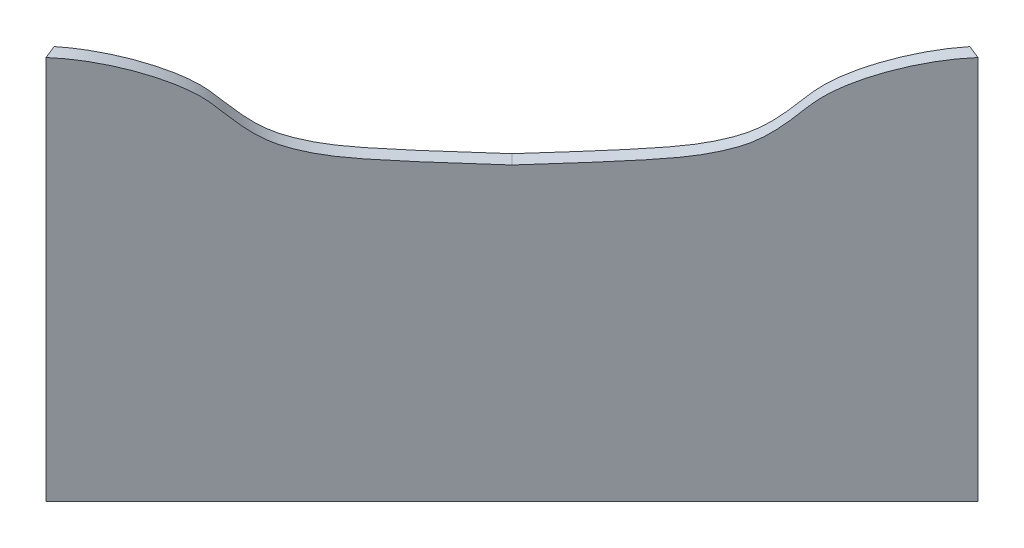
ISO-10303-21;
HEADER;
FILE_DESCRIPTION(('STEP AP214'),'2;1');
FILE_NAME('part.step','',(''),(''),'','','');
FILE_SCHEMA(('AUTOMOTIVE_DESIGN { 1 0 10303 214 1 1 1 1 }'));
ENDSEC;
DATA;
#1=APPLICATION_CONTEXT('core data for automotive mechanical design processes');
#2=APPLICATION_PROTOCOL_DEFINITION('international standard','automotive_design',2000,#1);
#3=PRODUCT_CONTEXT('',#1,'mechanical');
#4=PRODUCT('Part','Part','',(#3));
#5=PRODUCT_RELATED_PRODUCT_CATEGORY('part','',(#4));
#6=PRODUCT_DEFINITION_FORMATION('','',#4);
#7=PRODUCT_DEFINITION_CONTEXT('part definition',#1,'design');
#8=PRODUCT_DEFINITION('design','',#6,#7);
#9=PRODUCT_DEFINITION_SHAPE('','',#8);
#10=(LENGTH_UNIT() NAMED_UNIT(*) SI_UNIT(.MILLI.,.METRE.));
#11=(NAMED_UNIT(*) PLANE_ANGLE_UNIT() SI_UNIT($,.RADIAN.));
#12=(NAMED_UNIT(*) SI_UNIT($,.STERADIAN.) SOLID_ANGLE_UNIT());
#13=UNCERTAINTY_MEASURE_WITH_UNIT(LENGTH_MEASURE(1.E-05),#10,'distance_accuracy_value','');
#14=(GEOMETRIC_REPRESENTATION_CONTEXT(3) GLOBAL_UNCERTAINTY_ASSIGNED_CONTEXT((#13)) GLOBAL_UNIT_ASSIGNED_CONTEXT((#10,
#11,#12)) REPRESENTATION_CONTEXT('',''));
#15=CARTESIAN_POINT('',(0.,0.,0.));
#16=DIRECTION('',(0.,0.,1.));
#17=DIRECTION('',(1.,0.,0.));
#18=AXIS2_PLACEMENT_3D('',#15,#16,#17);
#19=CARTESIAN_POINT('',(0.,0.,0.));
#20=DIRECTION('',(0.,-1.,0.));
#21=DIRECTION('',(0.,0.,-1.));
#22=AXIS2_PLACEMENT_3D('',#19,#20,#21);
#23=PLANE('',#22);
#24=DIRECTION('',(0.707106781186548,0.,-0.707106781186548));
#25=VECTOR('',#24,1.);
#26=CARTESIAN_POINT('',(1219.2,0.,-853.078975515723));
#27=LINE('',#26,#25);
#28=CARTESIAN_POINT('',(366.121024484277,0.,0.));
#29=VERTEX_POINT('',#28);
#30=CARTESIAN_POINT('',(1219.2,0.,-853.078975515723));
#31=VERTEX_POINT('',#30);
#32=EDGE_CURVE('E96',#29,#31,#27,.T.);
#33=ORIENTED_EDGE('',*,*,#32,.F.);
#34=DIRECTION('',(0.382683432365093,0.,0.923879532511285));
#35=VECTOR('',#34,1.);
#36=CARTESIAN_POINT('',(366.121024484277,0.,0.));
#37=LINE('',#36,#35);
#38=CARTESIAN_POINT('',(355.6,0.,-25.4));
#39=VERTEX_POINT('',#38);
#40=EDGE_CURVE('E111',#39,#29,#37,.T.);
#41=ORIENTED_EDGE('',*,*,#40,.F.);
#42=DIRECTION('',(-0.707106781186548,0.,0.707106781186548));
#43=VECTOR('',#42,1.);
#44=CARTESIAN_POINT('',(355.6,0.,-25.4));
#45=LINE('',#44,#43);
#46=CARTESIAN_POINT('',(1193.8,0.,-863.6));
#47=VERTEX_POINT('',#46);
#48=EDGE_CURVE('E98',#47,#39,#45,.T.);
#49=ORIENTED_EDGE('',*,*,#48,.F.);
#50=DIRECTION('',(-0.923879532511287,0.,-0.382683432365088));
#51=VECTOR('',#50,1.);
#52=CARTESIAN_POINT('',(1193.8,0.,-863.6));
#53=LINE('',#52,#51);
#54=EDGE_CURVE('E84',#31,#47,#53,.T.);
#55=ORIENTED_EDGE('',*,*,#54,.F.);
#56=EDGE_LOOP('',(#33,#41,#49,#55));
#57=FACE_BOUND('',#56,.T.);
#58=ADVANCED_FACE('F32',(#57),#23,.T.);
#59=CARTESIAN_POINT('',(366.121024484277,831.851,0.));
#60=DIRECTION('',(0.923879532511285,0.,-0.382683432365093));
#61=DIRECTION('',(-0.382683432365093,0.,-0.923879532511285));
#62=AXIS2_PLACEMENT_3D('',#59,#60,#61);
#63=PLANE('',#62);
#64=DIRECTION('',(0.,-1.,0.));
#65=VECTOR('',#64,1.);
#66=CARTESIAN_POINT('',(366.121024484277,831.851,0.));
#67=LINE('',#66,#65);
#68=CARTESIAN_POINT('',(366.121024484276,703.815722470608,3.60822483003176E-13));
#69=VERTEX_POINT('',#68);
#70=EDGE_CURVE('E101',#69,#29,#67,.T.);
#71=ORIENTED_EDGE('',*,*,#70,.F.);
#72=CARTESIAN_POINT('',(366.121024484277,703.815722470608,1.87350135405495E-13));
#73=CARTESIAN_POINT('',(365.682591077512,703.797159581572,-1.05847187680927));
#74=CARTESIAN_POINT('',(365.244163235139,703.77770131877,-2.11693031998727));
#75=CARTESIAN_POINT('',(364.367322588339,703.737013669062,-4.2338109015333));
#76=CARTESIAN_POINT('',(363.928909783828,703.715784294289,-5.29223304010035));
#77=CARTESIAN_POINT('',(363.05209907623,703.671573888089,-7.409041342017));
#78=CARTESIAN_POINT('',(362.613701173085,703.648592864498,-8.46742750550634));
#79=CARTESIAN_POINT('',(361.736920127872,703.600897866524,-10.584164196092));
#80=CARTESIAN_POINT('',(361.298536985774,703.576183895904,-11.6425147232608));
#81=CARTESIAN_POINT('',(360.421785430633,703.525041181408,-13.7591802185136));
#82=CARTESIAN_POINT('',(359.983417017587,703.498612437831,-14.8174951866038));
#83=CARTESIAN_POINT('',(359.106694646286,703.444057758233,-16.9340902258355));
#84=CARTESIAN_POINT('',(358.668340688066,703.415931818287,-17.9923702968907));
#85=CARTESIAN_POINT('',(357.791647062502,703.357999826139,-20.1088959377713));
#86=CARTESIAN_POINT('',(357.353307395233,703.328193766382,-21.1671415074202));
#87=CARTESIAN_POINT('',(356.476642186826,703.266917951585,-23.2835985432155));
#88=CARTESIAN_POINT('',(356.038316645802,703.235448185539,-24.34181000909));
#89=CARTESIAN_POINT('',(355.600000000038,703.203154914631,-25.3999999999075));
#90=B_SPLINE_CURVE_WITH_KNOTS('',3,(#72,#73,#74,#75,#76,#77,#78,#79,#80,#81,#82,#83,#84,#85,#86,
#87,#88,#89),.UNSPECIFIED.,.F.,.F.,(4,2,2,2,2,2,2,2,4),(0.,3.43749583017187,6.87496811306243,
10.3124250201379,13.7498744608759,17.187323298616,20.6247800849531,24.0622523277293,
27.4997473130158),.UNSPECIFIED.);
#91=CARTESIAN_POINT('',(355.6,703.203154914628,-25.4));
#92=VERTEX_POINT('',#91);
#93=EDGE_CURVE('E52',#69,#92,#90,.T.);
#94=ORIENTED_EDGE('',*,*,#93,.T.);
#95=DIRECTION('',(0.,-1.,0.));
#96=VECTOR('',#95,1.);
#97=CARTESIAN_POINT('',(355.6,831.851,-25.4));
#98=LINE('',#97,#96);
#99=EDGE_CURVE('E114',#92,#39,#98,.T.);
#100=ORIENTED_EDGE('',*,*,#99,.T.);
#101=ORIENTED_EDGE('',*,*,#40,.T.);
#102=EDGE_LOOP('',(#71,#94,#100,#101));
#103=FACE_BOUND('',#102,.T.);
#104=ADVANCED_FACE('F127',(#103),#63,.F.);
#105=CARTESIAN_POINT('',(355.6,831.851,-25.4));
#106=DIRECTION('',(0.707106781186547,0.,0.707106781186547));
#107=DIRECTION('',(0.707106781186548,0.,-0.707106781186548));
#108=AXIS2_PLACEMENT_3D('',#105,#106,#107);
#109=PLANE('',#108);
#110=CARTESIAN_POINT('',(774.7,533.4,-444.5));
#111=CARTESIAN_POINT('',(653.950794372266,539.913589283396,-323.750794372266));
#112=CARTESIAN_POINT('',(612.359855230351,544.516452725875,-282.159855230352));
#113=CARTESIAN_POINT('',(558.49444223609,564.719403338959,-228.29444223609));
#114=CARTESIAN_POINT('',(535.096133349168,581.475854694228,-204.896133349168));
#115=CARTESIAN_POINT('',(476.347405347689,665.034466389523,-146.14740534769));
#116=CARTESIAN_POINT('',(399.493808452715,700.742078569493,-69.2938084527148));
#117=CARTESIAN_POINT('',(348.160512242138,703.815722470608,-17.960512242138));
#118=B_SPLINE_CURVE_WITH_KNOTS('',3,(#110,#111,#112,#113,#114,#115,#116,#117),.UNSPECIFIED.,.F.,
.F.,(4,1,1,1,1,4),(0.,0.332635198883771,0.406350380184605,0.700396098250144,0.763436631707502,
1.),.UNSPECIFIED.);
#119=CARTESIAN_POINT('',(774.7,533.4,-444.5));
#120=VERTEX_POINT('',#119);
#121=EDGE_CURVE('E123',#92,#120,#118,.F.);
#122=ORIENTED_EDGE('',*,*,#121,.T.);
#123=CARTESIAN_POINT('',(1201.23948775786,703.815722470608,-871.039487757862));
#124=CARTESIAN_POINT('',(1149.90619154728,700.742078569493,-819.706191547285));
#125=CARTESIAN_POINT('',(1073.05259465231,665.034466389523,-742.852594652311));
#126=CARTESIAN_POINT('',(1014.30386665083,581.475854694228,-684.103866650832));
#127=CARTESIAN_POINT('',(990.90555776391,564.719403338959,-660.70555776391));
#128=CARTESIAN_POINT('',(937.040144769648,544.516452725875,-606.840144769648));
#129=CARTESIAN_POINT('',(895.449205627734,539.913589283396,-565.249205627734));
#130=CARTESIAN_POINT('',(774.7,533.4,-444.5));
#131=B_SPLINE_CURVE_WITH_KNOTS('',3,(#123,#124,#125,#126,#127,#128,#129,#130),.UNSPECIFIED.,.F.,
.F.,(4,1,1,1,1,4),(0.,0.236563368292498,0.299603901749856,0.593649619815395,0.667364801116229,
1.),.UNSPECIFIED.);
#132=CARTESIAN_POINT('',(1193.80000000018,703.203154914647,-863.600000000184));
#133=VERTEX_POINT('',#132);
#134=EDGE_CURVE('E165',#120,#133,#131,.F.);
#135=ORIENTED_EDGE('',*,*,#134,.T.);
#136=DIRECTION('',(0.,-1.,0.));
#137=VECTOR('',#136,1.);
#138=CARTESIAN_POINT('',(1193.8,831.851,-863.6));
#139=LINE('',#138,#137);
#140=EDGE_CURVE('E91',#133,#47,#139,.T.);
#141=ORIENTED_EDGE('',*,*,#140,.T.);
#142=ORIENTED_EDGE('',*,*,#48,.T.);
#143=ORIENTED_EDGE('',*,*,#99,.F.);
#144=EDGE_LOOP('',(#122,#135,#141,#142,#143));
#145=FACE_BOUND('',#144,.T.);
#146=ADVANCED_FACE('F156',(#145),#109,.F.);
#147=CARTESIAN_POINT('',(1193.8,831.851,-863.6));
#148=DIRECTION('',(-0.382683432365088,0.,0.923879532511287));
#149=DIRECTION('',(0.923879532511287,0.,0.382683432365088));
#150=AXIS2_PLACEMENT_3D('',#147,#148,#149);
#151=PLANE('',#150);
#152=ORIENTED_EDGE('',*,*,#140,.F.);
#153=CARTESIAN_POINT('',(1193.8,703.203154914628,-863.6));
#154=CARTESIAN_POINT('',(1194.85818999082,703.235448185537,-863.161683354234));
#155=CARTESIAN_POINT('',(1195.9164014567,703.266917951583,-862.723357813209));
#156=CARTESIAN_POINT('',(1198.0328584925,703.328193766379,-861.846692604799));
#157=CARTESIAN_POINT('',(1199.09110406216,703.357999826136,-861.408352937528));
#158=CARTESIAN_POINT('',(1201.20762970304,703.415931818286,-860.531659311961));
#159=CARTESIAN_POINT('',(1202.2659097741,703.444057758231,-860.09330535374));
#160=CARTESIAN_POINT('',(1204.38250481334,703.49861243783,-859.216582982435));
#161=CARTESIAN_POINT('',(1205.44081978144,703.525041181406,-858.778214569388));
#162=CARTESIAN_POINT('',(1207.5574852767,703.576183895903,-857.901463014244));
#163=CARTESIAN_POINT('',(1208.61583580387,703.600897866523,-857.463079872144));
#164=CARTESIAN_POINT('',(1210.73257249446,703.648592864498,-856.586298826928));
#165=CARTESIAN_POINT('',(1211.79095865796,703.671573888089,-856.147900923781));
#166=CARTESIAN_POINT('',(1213.90776695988,703.715784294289,-855.27109021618));
#167=CARTESIAN_POINT('',(1214.96618909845,703.737013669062,-854.832677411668));
#168=CARTESIAN_POINT('',(1217.08306968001,703.77770131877,-853.955836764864));
#169=CARTESIAN_POINT('',(1218.14152812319,703.797159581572,-853.51740892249));
#170=CARTESIAN_POINT('',(1219.2,703.815722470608,-853.078975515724));
#171=B_SPLINE_CURVE_WITH_KNOTS('',3,(#153,#154,#155,#156,#157,#158,#159,#160,#161,#162,#163,
#164,#165,#166,#167,#168,#169,#170),.UNSPECIFIED.,.F.,.F.,(4,2,2,2,2,2,2,2,4),(0.,
3.43749498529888,6.87496722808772,10.3124240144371,13.7498728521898,17.1873222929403,
20.6247792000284,24.0622514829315,27.4997473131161),.UNSPECIFIED.);
#172=CARTESIAN_POINT('',(1219.2,703.815722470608,-853.078975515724));
#173=VERTEX_POINT('',#172);
#174=EDGE_CURVE('E87',#133,#173,#171,.T.);
#175=ORIENTED_EDGE('',*,*,#174,.T.);
#176=DIRECTION('',(0.,-1.,0.));
#177=VECTOR('',#176,1.);
#178=CARTESIAN_POINT('',(1219.2,831.851,-853.078975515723));
#179=LINE('',#178,#177);
#180=EDGE_CURVE('E80',#173,#31,#179,.T.);
#181=ORIENTED_EDGE('',*,*,#180,.T.);
#182=ORIENTED_EDGE('',*,*,#54,.T.);
#183=EDGE_LOOP('',(#152,#175,#181,#182));
#184=FACE_BOUND('',#183,.T.);
#185=ADVANCED_FACE('F83',(#184),#151,.F.);
#186=CARTESIAN_POINT('',(1219.2,831.851,-853.078975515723));
#187=DIRECTION('',(-0.707106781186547,0.,-0.707106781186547));
#188=DIRECTION('',(-0.707106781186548,0.,0.707106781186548));
#189=AXIS2_PLACEMENT_3D('',#186,#187,#188);
#190=PLANE('',#189);
#191=ORIENTED_EDGE('',*,*,#180,.F.);
#192=CARTESIAN_POINT('',(1219.2,703.815722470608,-853.078975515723));
#193=CARTESIAN_POINT('',(1167.86670378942,700.742078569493,-801.745679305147));
#194=CARTESIAN_POINT('',(1091.01310689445,665.034466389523,-724.892082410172));
#195=CARTESIAN_POINT('',(1032.26437889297,581.475854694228,-666.143354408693));
#196=CARTESIAN_POINT('',(1008.86607000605,564.719403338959,-642.745045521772));
#197=CARTESIAN_POINT('',(955.000657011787,544.516452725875,-588.87963252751));
#198=CARTESIAN_POINT('',(913.409717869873,539.913589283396,-547.288693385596));
#199=CARTESIAN_POINT('',(792.660512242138,533.4,-426.539487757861));
#200=B_SPLINE_CURVE_WITH_KNOTS('',3,(#192,#193,#194,#195,#196,#197,#198,#199),.UNSPECIFIED.,.F.,
.F.,(4,1,1,1,1,4),(0.,0.236563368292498,0.299603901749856,0.593649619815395,0.667364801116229,
1.),.UNSPECIFIED.);
#201=CARTESIAN_POINT('',(792.660512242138,533.4,-426.539487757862));
#202=VERTEX_POINT('',#201);
#203=EDGE_CURVE('E36',#173,#202,#200,.T.);
#204=ORIENTED_EDGE('',*,*,#203,.T.);
#205=CARTESIAN_POINT('',(792.660512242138,533.4,-426.539487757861));
#206=CARTESIAN_POINT('',(671.911306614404,539.913589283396,-305.790282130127));
#207=CARTESIAN_POINT('',(630.32036747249,544.516452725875,-264.199342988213));
#208=CARTESIAN_POINT('',(576.454954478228,564.719403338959,-210.333929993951));
#209=CARTESIAN_POINT('',(553.056645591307,581.475854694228,-186.93562110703));
#210=CARTESIAN_POINT('',(494.307917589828,665.034466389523,-128.186893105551));
#211=CARTESIAN_POINT('',(417.454320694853,700.742078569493,-51.3332962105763));
#212=CARTESIAN_POINT('',(366.121024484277,703.815722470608,5.57084040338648E-13));
#213=B_SPLINE_CURVE_WITH_KNOTS('',3,(#205,#206,#207,#208,#209,#210,#211,#212),.UNSPECIFIED.,.F.,
.F.,(4,1,1,1,1,4),(0.,0.332635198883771,0.406350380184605,0.700396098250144,0.763436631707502,
1.),.UNSPECIFIED.);
#214=EDGE_CURVE('E44',#202,#69,#213,.T.);
#215=ORIENTED_EDGE('',*,*,#214,.T.);
#216=ORIENTED_EDGE('',*,*,#70,.T.);
#217=ORIENTED_EDGE('',*,*,#32,.T.);
#218=EDGE_LOOP('',(#191,#204,#215,#216,#217));
#219=FACE_BOUND('',#218,.T.);
#220=ADVANCED_FACE('F34',(#219),#190,.F.);
#221=CARTESIAN_POINT('',(1219.2,703.815722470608,-853.078975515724));
#222=CARTESIAN_POINT('',(1167.86670378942,700.742078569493,-801.745679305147));
#223=CARTESIAN_POINT('',(1091.01310689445,665.034466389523,-724.892082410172));
#224=CARTESIAN_POINT('',(1032.26437889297,581.475854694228,-666.143354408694));
#225=CARTESIAN_POINT('',(1008.86607000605,564.719403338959,-642.745045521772));
#226=CARTESIAN_POINT('',(955.000657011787,544.516452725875,-588.87963252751));
#227=CARTESIAN_POINT('',(913.409717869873,539.913589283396,-547.288693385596));
#228=CARTESIAN_POINT('',(792.660512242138,533.4,-426.539487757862));
#229=B_SPLINE_CURVE_WITH_KNOTS('',3,(#221,#222,#223,#224,#225,#226,#227,#228),.UNSPECIFIED.,.F.,
.F.,(4,1,1,1,1,4),(0.,0.236563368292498,0.299603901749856,0.593649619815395,0.667364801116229,
1.),.UNSPECIFIED.);
#230=DIRECTION('',(-0.707106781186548,0.,-0.707106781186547));
#231=VECTOR('',#230,1.);
#232=SURFACE_OF_LINEAR_EXTRUSION('',#229,#231);
#233=ORIENTED_EDGE('',*,*,#134,.F.);
#234=DIRECTION('',(-0.707106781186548,0.,-0.707106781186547));
#235=VECTOR('',#234,1.);
#236=CARTESIAN_POINT('',(792.660512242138,533.4,-426.539487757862));
#237=LINE('',#236,#235);
#238=EDGE_CURVE('E11',#202,#120,#237,.T.);
#239=ORIENTED_EDGE('',*,*,#238,.F.);
#240=ORIENTED_EDGE('',*,*,#203,.F.);
#241=ORIENTED_EDGE('',*,*,#174,.F.);
#242=EDGE_LOOP('',(#233,#239,#240,#241));
#243=FACE_BOUND('',#242,.T.);
#244=ADVANCED_FACE('F135',(#243),#232,.F.);
#245=CARTESIAN_POINT('',(792.660512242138,533.4,-426.539487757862));
#246=CARTESIAN_POINT('',(671.911306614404,539.913589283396,-305.790282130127));
#247=CARTESIAN_POINT('',(630.32036747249,544.516452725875,-264.199342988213));
#248=CARTESIAN_POINT('',(576.454954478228,564.719403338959,-210.333929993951));
#249=CARTESIAN_POINT('',(553.056645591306,581.475854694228,-186.93562110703));
#250=CARTESIAN_POINT('',(494.307917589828,665.034466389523,-128.186893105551));
#251=CARTESIAN_POINT('',(417.454320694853,700.742078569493,-51.3332962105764));
#252=CARTESIAN_POINT('',(366.121024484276,703.815722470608,3.60822483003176E-13));
#253=B_SPLINE_CURVE_WITH_KNOTS('',3,(#245,#246,#247,#248,#249,#250,#251,#252),.UNSPECIFIED.,.F.,
.F.,(4,1,1,1,1,4),(0.,0.332635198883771,0.406350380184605,0.700396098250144,0.763436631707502,
1.),.UNSPECIFIED.);
#254=DIRECTION('',(-0.707106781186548,0.,-0.707106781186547));
#255=VECTOR('',#254,1.);
#256=SURFACE_OF_LINEAR_EXTRUSION('',#253,#255);
#257=ORIENTED_EDGE('',*,*,#214,.F.);
#258=ORIENTED_EDGE('',*,*,#238,.T.);
#259=ORIENTED_EDGE('',*,*,#121,.F.);
#260=ORIENTED_EDGE('',*,*,#93,.F.);
#261=EDGE_LOOP('',(#257,#258,#259,#260));
#262=FACE_BOUND('',#261,.T.);
#263=ADVANCED_FACE('F131',(#262),#256,.F.);
#264=CLOSED_SHELL('',(#58,#104,#146,#185,#220,#244,#263));
#265=MANIFOLD_SOLID_BREP('B2',#264);
#266=ADVANCED_BREP_SHAPE_REPRESENTATION('',(#18,#265),#14);
#267=SHAPE_DEFINITION_REPRESENTATION(#9,#266);
ENDSEC;
END-ISO-10303-21;
